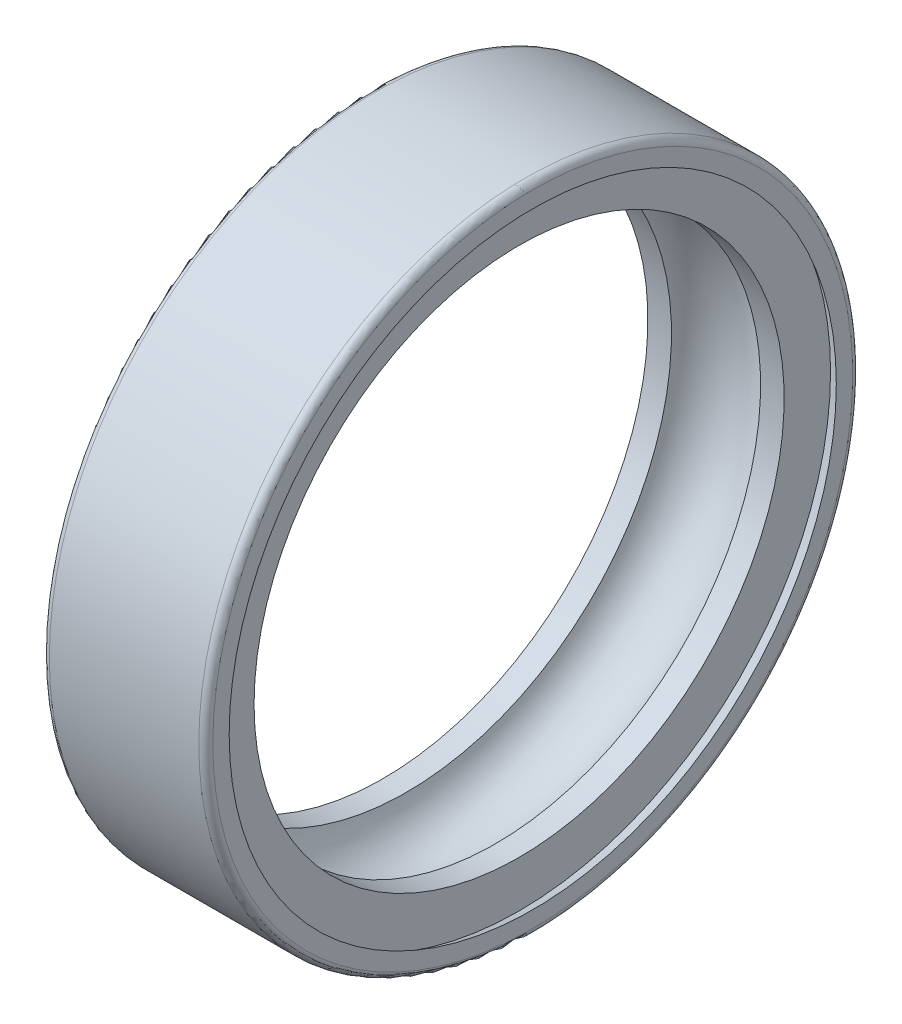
ISO-10303-21;
HEADER;
FILE_DESCRIPTION(('STEP AP214'),'2;1');
FILE_NAME('part.step','',(''),(''),'','','');
FILE_SCHEMA(('AUTOMOTIVE_DESIGN { 1 0 10303 214 1 1 1 1 }'));
ENDSEC;
DATA;
#1=APPLICATION_CONTEXT('core data for automotive mechanical design processes');
#2=APPLICATION_PROTOCOL_DEFINITION('international standard','automotive_design',2000,#1);
#3=PRODUCT_CONTEXT('',#1,'mechanical');
#4=PRODUCT('Part','Part','',(#3));
#5=PRODUCT_RELATED_PRODUCT_CATEGORY('part','',(#4));
#6=PRODUCT_DEFINITION_FORMATION('','',#4);
#7=PRODUCT_DEFINITION_CONTEXT('part definition',#1,'design');
#8=PRODUCT_DEFINITION('design','',#6,#7);
#9=PRODUCT_DEFINITION_SHAPE('','',#8);
#10=(LENGTH_UNIT() NAMED_UNIT(*) SI_UNIT(.MILLI.,.METRE.));
#11=(NAMED_UNIT(*) PLANE_ANGLE_UNIT() SI_UNIT($,.RADIAN.));
#12=(NAMED_UNIT(*) SI_UNIT($,.STERADIAN.) SOLID_ANGLE_UNIT());
#13=UNCERTAINTY_MEASURE_WITH_UNIT(LENGTH_MEASURE(1.E-05),#10,'distance_accuracy_value','');
#14=(GEOMETRIC_REPRESENTATION_CONTEXT(3) GLOBAL_UNCERTAINTY_ASSIGNED_CONTEXT((#13)) GLOBAL_UNIT_ASSIGNED_CONTEXT((#10,
#11,#12)) REPRESENTATION_CONTEXT('',''));
#15=CARTESIAN_POINT('',(0.,0.,0.));
#16=DIRECTION('',(0.,0.,1.));
#17=DIRECTION('',(1.,0.,0.));
#18=AXIS2_PLACEMENT_3D('',#15,#16,#17);
#19=CARTESIAN_POINT('',(0.,0.,0.));
#20=DIRECTION('',(-1.,0.,0.));
#21=DIRECTION('',(0.,0.,1.));
#22=AXIS2_PLACEMENT_3D('',#19,#20,#21);
#23=CYLINDRICAL_SURFACE('',#22,11.35);
#24=CARTESIAN_POINT('',(6.41666666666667,0.,0.));
#25=DIRECTION('',(-1.,0.,0.));
#26=DIRECTION('',(0.,0.,1.));
#27=AXIS2_PLACEMENT_3D('',#24,#25,#26);
#28=CIRCLE('',#27,11.35);
#29=CARTESIAN_POINT('',(6.41666666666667,0.,11.35));
#30=VERTEX_POINT('',#29);
#31=EDGE_CURVE('E10',#30,#30,#28,.T.);
#32=ORIENTED_EDGE('',*,*,#31,.F.);
#33=EDGE_LOOP('',(#32));
#34=FACE_BOUND('',#33,.T.);
#35=CARTESIAN_POINT('',(5.40787840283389,0.,0.));
#36=DIRECTION('',(-1.,0.,0.));
#37=DIRECTION('',(0.,0.,1.));
#38=AXIS2_PLACEMENT_3D('',#35,#36,#37);
#39=CIRCLE('',#38,11.35);
#40=CARTESIAN_POINT('',(5.40787840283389,0.,11.35));
#41=VERTEX_POINT('',#40);
#42=EDGE_CURVE('E72',#41,#41,#39,.T.);
#43=ORIENTED_EDGE('',*,*,#42,.T.);
#44=EDGE_LOOP('',(#43));
#45=FACE_BOUND('',#44,.T.);
#46=ADVANCED_FACE('F14',(#34,#45),#23,.F.);
#47=CARTESIAN_POINT('',(6.41666666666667,11.35,0.));
#48=DIRECTION('',(-1.,0.,0.));
#49=DIRECTION('',(0.,0.,1.));
#50=AXIS2_PLACEMENT_3D('',#47,#48,#49);
#51=PLANE('',#50);
#52=CARTESIAN_POINT('',(6.41666666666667,0.,0.));
#53=DIRECTION('',(-1.,0.,0.));
#54=DIRECTION('',(0.,0.,1.));
#55=AXIS2_PLACEMENT_3D('',#52,#53,#54);
#56=CIRCLE('',#55,13.3367876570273);
#57=CARTESIAN_POINT('',(6.41666666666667,0.,13.3367876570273));
#58=VERTEX_POINT('',#57);
#59=EDGE_CURVE('E21',#58,#58,#56,.T.);
#60=ORIENTED_EDGE('',*,*,#59,.F.);
#61=EDGE_LOOP('',(#60));
#62=FACE_BOUND('',#61,.T.);
#63=ORIENTED_EDGE('',*,*,#31,.T.);
#64=EDGE_LOOP('',(#63));
#65=FACE_BOUND('',#64,.T.);
#66=ADVANCED_FACE('F91',(#62,#65),#51,.F.);
#67=CARTESIAN_POINT('',(6.41666666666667,0.,0.));
#68=DIRECTION('',(-1.,0.,0.));
#69=DIRECTION('',(0.,0.,1.));
#70=AXIS2_PLACEMENT_3D('',#67,#68,#69);
#71=CONICAL_SURFACE('',#70,13.3367876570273,0.523598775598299);
#72=CARTESIAN_POINT('',(7.,0.,0.));
#73=DIRECTION('',(-1.,0.,0.));
#74=DIRECTION('',(0.,0.,1.));
#75=AXIS2_PLACEMENT_3D('',#72,#73,#74);
#76=CIRCLE('',#75,13.);
#77=CARTESIAN_POINT('',(7.,0.,13.));
#78=VERTEX_POINT('',#77);
#79=EDGE_CURVE('E30',#78,#78,#76,.T.);
#80=ORIENTED_EDGE('',*,*,#79,.F.);
#81=EDGE_LOOP('',(#80));
#82=FACE_BOUND('',#81,.T.);
#83=ORIENTED_EDGE('',*,*,#59,.T.);
#84=EDGE_LOOP('',(#83));
#85=FACE_BOUND('',#84,.T.);
#86=ADVANCED_FACE('F96',(#82,#85),#71,.F.);
#87=CARTESIAN_POINT('',(7.,13.,0.));
#88=DIRECTION('',(-1.,0.,0.));
#89=DIRECTION('',(0.,0.,1.));
#90=AXIS2_PLACEMENT_3D('',#87,#88,#89);
#91=PLANE('',#90);
#92=CARTESIAN_POINT('',(7.,0.,0.));
#93=DIRECTION('',(-1.,0.,0.));
#94=DIRECTION('',(0.,0.,1.));
#95=AXIS2_PLACEMENT_3D('',#92,#93,#94);
#96=CIRCLE('',#95,13.7);
#97=CARTESIAN_POINT('',(7.,0.,13.7));
#98=VERTEX_POINT('',#97);
#99=EDGE_CURVE('E38',#98,#98,#96,.T.);
#100=ORIENTED_EDGE('',*,*,#99,.F.);
#101=EDGE_LOOP('',(#100));
#102=FACE_BOUND('',#101,.T.);
#103=ORIENTED_EDGE('',*,*,#79,.T.);
#104=EDGE_LOOP('',(#103));
#105=FACE_BOUND('',#104,.T.);
#106=ADVANCED_FACE('F101',(#102,#105),#91,.F.);
#107=CARTESIAN_POINT('',(6.7,0.,0.));
#108=DIRECTION('',(-1.,0.,0.));
#109=DIRECTION('',(0.,0.,1.));
#110=AXIS2_PLACEMENT_3D('',#107,#108,#109);
#111=TOROIDAL_SURFACE('',#110,13.7,0.3);
#112=CARTESIAN_POINT('',(6.7,0.,0.));
#113=DIRECTION('',(-1.,0.,0.));
#114=DIRECTION('',(0.,0.,1.));
#115=AXIS2_PLACEMENT_3D('',#112,#113,#114);
#116=CIRCLE('',#115,14.);
#117=CARTESIAN_POINT('',(6.7,0.,14.));
#118=VERTEX_POINT('',#117);
#119=EDGE_CURVE('E44',#118,#118,#116,.T.);
#120=ORIENTED_EDGE('',*,*,#119,.F.);
#121=EDGE_LOOP('',(#120));
#122=FACE_BOUND('',#121,.T.);
#123=ORIENTED_EDGE('',*,*,#99,.T.);
#124=EDGE_LOOP('',(#123));
#125=FACE_BOUND('',#124,.T.);
#126=ADVANCED_FACE('F107',(#122,#125),#111,.T.);
#127=CARTESIAN_POINT('',(0.,0.,0.));
#128=DIRECTION('',(-1.,0.,0.));
#129=DIRECTION('',(0.,0.,1.));
#130=AXIS2_PLACEMENT_3D('',#127,#128,#129);
#131=CYLINDRICAL_SURFACE('',#130,14.);
#132=CARTESIAN_POINT('',(0.3,0.,0.));
#133=DIRECTION('',(-1.,0.,0.));
#134=DIRECTION('',(0.,0.,1.));
#135=AXIS2_PLACEMENT_3D('',#132,#133,#134);
#136=CIRCLE('',#135,14.);
#137=CARTESIAN_POINT('',(0.3,0.,14.));
#138=VERTEX_POINT('',#137);
#139=EDGE_CURVE('E48',#138,#138,#136,.T.);
#140=ORIENTED_EDGE('',*,*,#139,.F.);
#141=EDGE_LOOP('',(#140));
#142=FACE_BOUND('',#141,.T.);
#143=ORIENTED_EDGE('',*,*,#119,.T.);
#144=EDGE_LOOP('',(#143));
#145=FACE_BOUND('',#144,.T.);
#146=ADVANCED_FACE('F111',(#142,#145),#131,.T.);
#147=CARTESIAN_POINT('',(0.3,0.,0.));
#148=DIRECTION('',(-1.,0.,0.));
#149=DIRECTION('',(0.,0.,1.));
#150=AXIS2_PLACEMENT_3D('',#147,#148,#149);
#151=TOROIDAL_SURFACE('',#150,13.7,0.3);
#152=CARTESIAN_POINT('',(0.,0.,0.));
#153=DIRECTION('',(-1.,0.,0.));
#154=DIRECTION('',(0.,0.,1.));
#155=AXIS2_PLACEMENT_3D('',#152,#153,#154);
#156=CIRCLE('',#155,13.7);
#157=CARTESIAN_POINT('',(0.,0.,13.7));
#158=VERTEX_POINT('',#157);
#159=EDGE_CURVE('E52',#158,#158,#156,.T.);
#160=ORIENTED_EDGE('',*,*,#159,.F.);
#161=EDGE_LOOP('',(#160));
#162=FACE_BOUND('',#161,.T.);
#163=ORIENTED_EDGE('',*,*,#139,.T.);
#164=EDGE_LOOP('',(#163));
#165=FACE_BOUND('',#164,.T.);
#166=ADVANCED_FACE('F115',(#162,#165),#151,.T.);
#167=CARTESIAN_POINT('',(0.,13.7,0.));
#168=DIRECTION('',(1.,0.,0.));
#169=DIRECTION('',(0.,0.,-1.));
#170=AXIS2_PLACEMENT_3D('',#167,#168,#169);
#171=PLANE('',#170);
#172=CARTESIAN_POINT('',(0.,0.,0.));
#173=DIRECTION('',(-1.,0.,0.));
#174=DIRECTION('',(0.,0.,1.));
#175=AXIS2_PLACEMENT_3D('',#172,#173,#174);
#176=CIRCLE('',#175,13.);
#177=CARTESIAN_POINT('',(0.,0.,13.));
#178=VERTEX_POINT('',#177);
#179=EDGE_CURVE('E56',#178,#178,#176,.T.);
#180=ORIENTED_EDGE('',*,*,#179,.F.);
#181=EDGE_LOOP('',(#180));
#182=FACE_BOUND('',#181,.T.);
#183=ORIENTED_EDGE('',*,*,#159,.T.);
#184=EDGE_LOOP('',(#183));
#185=FACE_BOUND('',#184,.T.);
#186=ADVANCED_FACE('F119',(#182,#185),#171,.F.);
#187=CARTESIAN_POINT('',(0.,0.,0.));
#188=DIRECTION('',(1.,0.,0.));
#189=DIRECTION('',(0.,0.,-1.));
#190=AXIS2_PLACEMENT_3D('',#187,#188,#189);
#191=CONICAL_SURFACE('',#190,13.,0.523598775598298);
#192=CARTESIAN_POINT('',(0.583333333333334,0.,0.));
#193=DIRECTION('',(-1.,0.,0.));
#194=DIRECTION('',(0.,0.,1.));
#195=AXIS2_PLACEMENT_3D('',#192,#193,#194);
#196=CIRCLE('',#195,13.3367876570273);
#197=CARTESIAN_POINT('',(0.583333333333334,0.,13.3367876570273));
#198=VERTEX_POINT('',#197);
#199=EDGE_CURVE('E60',#198,#198,#196,.T.);
#200=ORIENTED_EDGE('',*,*,#199,.F.);
#201=EDGE_LOOP('',(#200));
#202=FACE_BOUND('',#201,.T.);
#203=ORIENTED_EDGE('',*,*,#179,.T.);
#204=EDGE_LOOP('',(#203));
#205=FACE_BOUND('',#204,.T.);
#206=ADVANCED_FACE('F123',(#202,#205),#191,.F.);
#207=CARTESIAN_POINT('',(0.583333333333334,13.3367876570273,0.));
#208=DIRECTION('',(1.,0.,0.));
#209=DIRECTION('',(0.,0.,-1.));
#210=AXIS2_PLACEMENT_3D('',#207,#208,#209);
#211=PLANE('',#210);
#212=CARTESIAN_POINT('',(0.583333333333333,0.,0.));
#213=DIRECTION('',(-1.,0.,0.));
#214=DIRECTION('',(0.,0.,1.));
#215=AXIS2_PLACEMENT_3D('',#212,#213,#214);
#216=CIRCLE('',#215,11.35);
#217=CARTESIAN_POINT('',(0.583333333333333,0.,11.35));
#218=VERTEX_POINT('',#217);
#219=EDGE_CURVE('E64',#218,#218,#216,.T.);
#220=ORIENTED_EDGE('',*,*,#219,.F.);
#221=EDGE_LOOP('',(#220));
#222=FACE_BOUND('',#221,.T.);
#223=ORIENTED_EDGE('',*,*,#199,.T.);
#224=EDGE_LOOP('',(#223));
#225=FACE_BOUND('',#224,.T.);
#226=ADVANCED_FACE('F87',(#222,#225),#211,.F.);
#227=CARTESIAN_POINT('',(0.,0.,0.));
#228=DIRECTION('',(-1.,0.,0.));
#229=DIRECTION('',(0.,0.,1.));
#230=AXIS2_PLACEMENT_3D('',#227,#228,#229);
#231=CYLINDRICAL_SURFACE('',#230,11.35);
#232=CARTESIAN_POINT('',(1.59212159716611,0.,0.));
#233=DIRECTION('',(-1.,0.,0.));
#234=DIRECTION('',(0.,0.,1.));
#235=AXIS2_PLACEMENT_3D('',#232,#233,#234);
#236=CIRCLE('',#235,11.35);
#237=CARTESIAN_POINT('',(1.59212159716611,0.,11.35));
#238=VERTEX_POINT('',#237);
#239=EDGE_CURVE('E68',#238,#238,#236,.T.);
#240=ORIENTED_EDGE('',*,*,#239,.F.);
#241=EDGE_LOOP('',(#240));
#242=FACE_BOUND('',#241,.T.);
#243=ORIENTED_EDGE('',*,*,#219,.T.);
#244=EDGE_LOOP('',(#243));
#245=FACE_BOUND('',#244,.T.);
#246=ADVANCED_FACE('F80',(#242,#245),#231,.F.);
#247=CARTESIAN_POINT('',(3.5,0.,0.));
#248=DIRECTION('',(-1.,0.,0.));
#249=DIRECTION('',(0.,0.,1.));
#250=AXIS2_PLACEMENT_3D('',#247,#248,#249);
#251=TOROIDAL_SURFACE('',#250,10.75,2.);
#252=ORIENTED_EDGE('',*,*,#239,.T.);
#253=EDGE_LOOP('',(#252));
#254=FACE_BOUND('',#253,.T.);
#255=ORIENTED_EDGE('',*,*,#42,.F.);
#256=EDGE_LOOP('',(#255));
#257=FACE_BOUND('',#256,.T.);
#258=ADVANCED_FACE('F78',(#254,#257),#251,.F.);
#259=CLOSED_SHELL('',(#46,#66,#86,#106,#126,#146,#166,#186,#206,#226,#246,#258));
#260=MANIFOLD_SOLID_BREP('B1',#259);
#261=ADVANCED_BREP_SHAPE_REPRESENTATION('',(#18,#260),#14);
#262=SHAPE_DEFINITION_REPRESENTATION(#9,#261);
ENDSEC;
END-ISO-10303-21;
